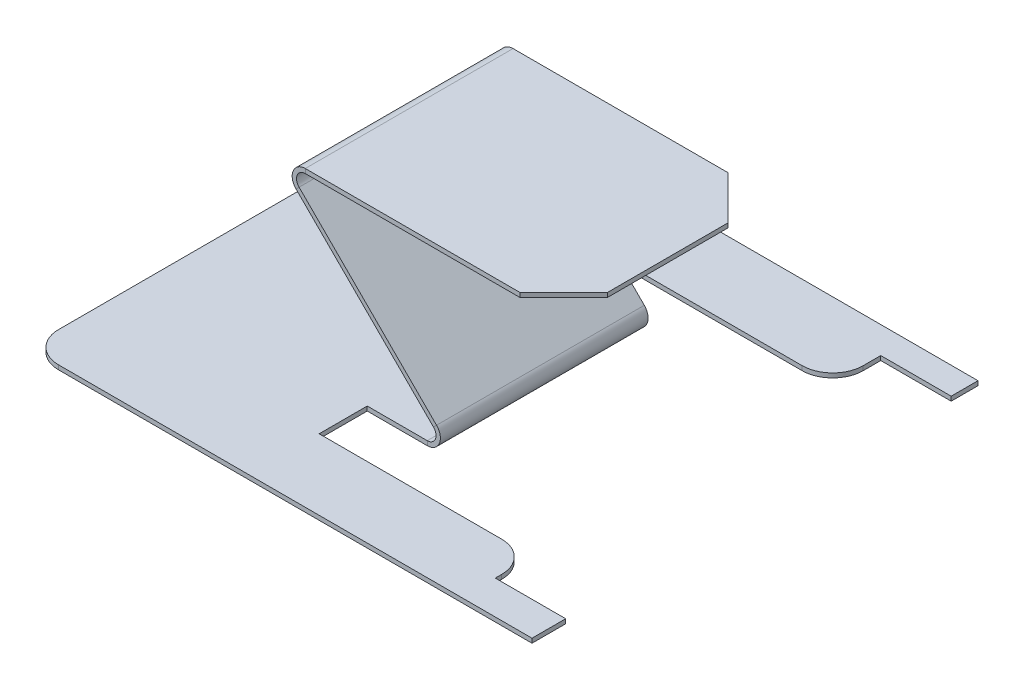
ISO-10303-21;
HEADER;
FILE_DESCRIPTION(('STEP AP214'),'2;1');
FILE_NAME('part.step','',(''),(''),'','','');
FILE_SCHEMA(('AUTOMOTIVE_DESIGN { 1 0 10303 214 1 1 1 1 }'));
ENDSEC;
DATA;
#1=APPLICATION_CONTEXT('core data for automotive mechanical design processes');
#2=APPLICATION_PROTOCOL_DEFINITION('international standard','automotive_design',2000,#1);
#3=PRODUCT_CONTEXT('',#1,'mechanical');
#4=PRODUCT('Part','Part','',(#3));
#5=PRODUCT_RELATED_PRODUCT_CATEGORY('part','',(#4));
#6=PRODUCT_DEFINITION_FORMATION('','',#4);
#7=PRODUCT_DEFINITION_CONTEXT('part definition',#1,'design');
#8=PRODUCT_DEFINITION('design','',#6,#7);
#9=PRODUCT_DEFINITION_SHAPE('','',#8);
#10=(LENGTH_UNIT() NAMED_UNIT(*) SI_UNIT(.MILLI.,.METRE.));
#11=(NAMED_UNIT(*) PLANE_ANGLE_UNIT() SI_UNIT($,.RADIAN.));
#12=(NAMED_UNIT(*) SI_UNIT($,.STERADIAN.) SOLID_ANGLE_UNIT());
#13=UNCERTAINTY_MEASURE_WITH_UNIT(LENGTH_MEASURE(1.E-05),#10,'distance_accuracy_value','');
#14=(GEOMETRIC_REPRESENTATION_CONTEXT(3) GLOBAL_UNCERTAINTY_ASSIGNED_CONTEXT((#13)) GLOBAL_UNIT_ASSIGNED_CONTEXT((#10,
#11,#12)) REPRESENTATION_CONTEXT('',''));
#15=CARTESIAN_POINT('',(0.,0.,0.));
#16=DIRECTION('',(0.,0.,1.));
#17=DIRECTION('',(1.,0.,0.));
#18=AXIS2_PLACEMENT_3D('',#15,#16,#17);
#19=CARTESIAN_POINT('',(24.2169050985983,36.4189178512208,41.4697311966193));
#20=DIRECTION('',(0.707106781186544,0.707106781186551,0.));
#21=DIRECTION('',(0.,0.,-1.));
#22=AXIS2_PLACEMENT_3D('',#19,#20,#21);
#23=PLANE('',#22);
#24=DIRECTION('',(-0.707106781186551,0.707106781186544,0.));
#25=VECTOR('',#24,1.);
#26=CARTESIAN_POINT('',(70.1039701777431,-9.46814722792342,22.0110102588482));
#27=LINE('',#26,#25);
#28=CARTESIAN_POINT('',(56.2216093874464,4.4142135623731,22.0110102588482));
#29=VERTEX_POINT('',#28);
#30=CARTESIAN_POINT('',(24.7571432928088,35.8786796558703,22.0110102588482));
#31=VERTEX_POINT('',#30);
#32=EDGE_CURVE('E428',#29,#31,#27,.T.);
#33=ORIENTED_EDGE('',*,*,#32,.T.);
#34=DIRECTION('',(0.,0.,-1.));
#35=VECTOR('',#34,1.);
#36=CARTESIAN_POINT('',(24.7571432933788,35.8786796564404,41.4697311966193));
#37=LINE('',#36,#35);
#38=CARTESIAN_POINT('',(24.7571432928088,35.8786796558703,-25.5547520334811));
#39=VERTEX_POINT('',#38);
#40=EDGE_CURVE('E269',#31,#39,#37,.T.);
#41=ORIENTED_EDGE('',*,*,#40,.T.);
#42=DIRECTION('',(0.707106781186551,-0.707106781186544,0.));
#43=VECTOR('',#42,1.);
#44=CARTESIAN_POINT('',(17.5497955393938,43.0860274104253,-25.5547520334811));
#45=LINE('',#44,#43);
#46=CARTESIAN_POINT('',(56.2216094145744,4.4142135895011,-25.5547520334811));
#47=VERTEX_POINT('',#46);
#48=EDGE_CURVE('E407',#39,#47,#45,.T.);
#49=ORIENTED_EDGE('',*,*,#48,.T.);
#50=DIRECTION('',(0.,0.,-1.));
#51=VECTOR('',#50,1.);
#52=CARTESIAN_POINT('',(56.2216093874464,4.41421356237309,41.4697311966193));
#53=LINE('',#52,#51);
#54=EDGE_CURVE('E403',#29,#47,#53,.T.);
#55=ORIENTED_EDGE('',*,*,#54,.F.);
#56=EDGE_LOOP('',(#33,#41,#49,#55));
#57=FACE_BOUND('',#56,.T.);
#58=ADVANCED_FACE('F34',(#57),#23,.F.);
#59=CARTESIAN_POINT('',(17.5497955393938,43.0860274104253,-25.5547520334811));
#60=DIRECTION('',(0.,0.,1.));
#61=DIRECTION('',(-0.707106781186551,0.707106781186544,0.));
#62=AXIS2_PLACEMENT_3D('',#59,#60,#61);
#63=PLANE('',#62);
#64=ORIENTED_EDGE('',*,*,#48,.F.);
#65=DIRECTION('',(0.707106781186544,0.707106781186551,0.));
#66=VECTOR('',#65,1.);
#67=CARTESIAN_POINT('',(24.7571432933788,35.8786796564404,-25.5547520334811));
#68=LINE('',#67,#66);
#69=CARTESIAN_POINT('',(25.4642500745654,36.5857864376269,-25.5547520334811));
#70=VERTEX_POINT('',#69);
#71=EDGE_CURVE('E422',#39,#70,#68,.T.);
#72=ORIENTED_EDGE('',*,*,#71,.T.);
#73=DIRECTION('',(0.707106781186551,-0.707106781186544,0.));
#74=VECTOR('',#73,1.);
#75=CARTESIAN_POINT('',(18.2569023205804,43.7931341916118,-25.5547520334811));
#76=LINE('',#75,#74);
#77=CARTESIAN_POINT('',(56.9287161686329,5.12132034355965,-25.5547520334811));
#78=VERTEX_POINT('',#77);
#79=EDGE_CURVE('E426',#70,#78,#76,.T.);
#80=ORIENTED_EDGE('',*,*,#79,.T.);
#81=DIRECTION('',(0.707106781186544,0.707106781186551,0.));
#82=VECTOR('',#81,1.);
#83=CARTESIAN_POINT('',(56.2216093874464,4.4142135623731,-25.5547520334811));
#84=LINE('',#83,#82);
#85=EDGE_CURVE('E406',#47,#78,#84,.T.);
#86=ORIENTED_EDGE('',*,*,#85,.F.);
#87=EDGE_LOOP('',(#64,#72,#80,#86));
#88=FACE_BOUND('',#87,.T.);
#89=ADVANCED_FACE('F36',(#88),#63,.F.);
#90=CARTESIAN_POINT('',(70.1039701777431,-9.46814722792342,22.0110102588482));
#91=DIRECTION('',(0.,0.,-1.));
#92=DIRECTION('',(0.707106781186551,-0.707106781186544,0.));
#93=AXIS2_PLACEMENT_3D('',#90,#91,#92);
#94=PLANE('',#93);
#95=DIRECTION('',(-0.707106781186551,0.707106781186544,0.));
#96=VECTOR('',#95,1.);
#97=CARTESIAN_POINT('',(70.8110769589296,-8.76104044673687,22.0110102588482));
#98=LINE('',#97,#96);
#99=CARTESIAN_POINT('',(56.928716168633,5.12132034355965,22.0110102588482));
#100=VERTEX_POINT('',#99);
#101=CARTESIAN_POINT('',(25.4642500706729,36.5857864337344,22.0110102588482));
#102=VERTEX_POINT('',#101);
#103=EDGE_CURVE('E295',#100,#102,#98,.T.);
#104=ORIENTED_EDGE('',*,*,#103,.T.);
#105=DIRECTION('',(-0.707106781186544,-0.707106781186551,0.));
#106=VECTOR('',#105,1.);
#107=CARTESIAN_POINT('',(24.7571432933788,35.8786796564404,22.0110102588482));
#108=LINE('',#107,#106);
#109=EDGE_CURVE('E417',#102,#31,#108,.T.);
#110=ORIENTED_EDGE('',*,*,#109,.T.);
#111=ORIENTED_EDGE('',*,*,#32,.F.);
#112=DIRECTION('',(-0.707106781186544,-0.707106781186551,0.));
#113=VECTOR('',#112,1.);
#114=CARTESIAN_POINT('',(56.2216093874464,4.4142135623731,22.0110102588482));
#115=LINE('',#114,#113);
#116=EDGE_CURVE('E413',#100,#29,#115,.T.);
#117=ORIENTED_EDGE('',*,*,#116,.F.);
#118=EDGE_LOOP('',(#104,#110,#111,#117));
#119=FACE_BOUND('',#118,.T.);
#120=ADVANCED_FACE('F580',(#119),#94,.F.);
#121=CARTESIAN_POINT('',(24.9240118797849,37.1260246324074,41.4697311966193));
#122=DIRECTION('',(0.707106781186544,0.707106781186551,0.));
#123=DIRECTION('',(0.,0.,-1.));
#124=AXIS2_PLACEMENT_3D('',#121,#122,#123);
#125=PLANE('',#124);
#126=DIRECTION('',(0.,0.,-1.));
#127=VECTOR('',#126,1.);
#128=CARTESIAN_POINT('',(25.4642500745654,36.5857864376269,41.4697311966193));
#129=LINE('',#128,#127);
#130=EDGE_CURVE('E420',#102,#70,#129,.T.);
#131=ORIENTED_EDGE('',*,*,#130,.F.);
#132=ORIENTED_EDGE('',*,*,#103,.F.);
#133=DIRECTION('',(0.,0.,-1.));
#134=VECTOR('',#133,1.);
#135=CARTESIAN_POINT('',(56.928716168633,5.12132034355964,41.4697311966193));
#136=LINE('',#135,#134);
#137=EDGE_CURVE('E410',#100,#78,#136,.T.);
#138=ORIENTED_EDGE('',*,*,#137,.T.);
#139=ORIENTED_EDGE('',*,*,#79,.F.);
#140=EDGE_LOOP('',(#131,#132,#138,#139));
#141=FACE_BOUND('',#140,.T.);
#142=ADVANCED_FACE('F586',(#141),#125,.T.);
#143=CARTESIAN_POINT('',(41.0652591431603,1.,33.0179635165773));
#144=DIRECTION('',(-1.,0.,0.));
#145=DIRECTION('',(0.,0.,1.));
#146=AXIS2_PLACEMENT_3D('',#143,#144,#145);
#147=PLANE('',#146);
#148=DIRECTION('',(0.,0.,-1.));
#149=VECTOR('',#148,1.);
#150=CARTESIAN_POINT('',(41.0652591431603,0.,33.0179635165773));
#151=LINE('',#150,#149);
#152=CARTESIAN_POINT('',(41.0652591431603,0.,33.0179635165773));
#153=VERTEX_POINT('',#152);
#154=CARTESIAN_POINT('',(41.0652591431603,0.,22.0110102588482));
#155=VERTEX_POINT('',#154);
#156=EDGE_CURVE('E400',#153,#155,#151,.T.);
#157=ORIENTED_EDGE('',*,*,#156,.T.);
#158=DIRECTION('',(0.,-1.,0.));
#159=VECTOR('',#158,1.);
#160=CARTESIAN_POINT('',(41.0652591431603,1.,22.0110102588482));
#161=LINE('',#160,#159);
#162=CARTESIAN_POINT('',(41.0652591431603,1.,22.0110102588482));
#163=VERTEX_POINT('',#162);
#164=EDGE_CURVE('E292',#163,#155,#161,.T.);
#165=ORIENTED_EDGE('',*,*,#164,.F.);
#166=DIRECTION('',(0.,0.,-1.));
#167=VECTOR('',#166,1.);
#168=CARTESIAN_POINT('',(41.0652591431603,1.,33.0179635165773));
#169=LINE('',#168,#167);
#170=CARTESIAN_POINT('',(41.0652591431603,1.,33.0179635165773));
#171=VERTEX_POINT('',#170);
#172=EDGE_CURVE('E307',#171,#163,#169,.T.);
#173=ORIENTED_EDGE('',*,*,#172,.F.);
#174=DIRECTION('',(0.,-1.,0.));
#175=VECTOR('',#174,1.);
#176=CARTESIAN_POINT('',(41.0652591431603,1.,33.0179635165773));
#177=LINE('',#176,#175);
#178=EDGE_CURVE('E397',#171,#153,#177,.T.);
#179=ORIENTED_EDGE('',*,*,#178,.T.);
#180=EDGE_LOOP('',(#157,#165,#173,#179));
#181=FACE_BOUND('',#180,.T.);
#182=ADVANCED_FACE('F494',(#181),#147,.F.);
#183=CARTESIAN_POINT('',(89.8362298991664,1.,33.0179635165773));
#184=DIRECTION('',(0.,0.,1.));
#185=DIRECTION('',(1.,0.,0.));
#186=AXIS2_PLACEMENT_3D('',#183,#184,#185);
#187=PLANE('',#186);
#188=DIRECTION('',(-1.,0.,0.));
#189=VECTOR('',#188,1.);
#190=CARTESIAN_POINT('',(89.8362298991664,1.,33.0179635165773));
#191=LINE('',#190,#189);
#192=CARTESIAN_POINT('',(82.8362298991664,1.,33.0179635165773));
#193=VERTEX_POINT('',#192);
#194=EDGE_CURVE('E309',#193,#171,#191,.T.);
#195=ORIENTED_EDGE('',*,*,#194,.F.);
#196=DIRECTION('',(0.,-1.,0.));
#197=VECTOR('',#196,1.);
#198=CARTESIAN_POINT('',(82.8362298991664,1.,33.0179635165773));
#199=LINE('',#198,#197);
#200=CARTESIAN_POINT('',(82.8362298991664,0.,33.0179635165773));
#201=VERTEX_POINT('',#200);
#202=EDGE_CURVE('E477',#193,#201,#199,.T.);
#203=ORIENTED_EDGE('',*,*,#202,.T.);
#204=DIRECTION('',(-1.,0.,0.));
#205=VECTOR('',#204,1.);
#206=CARTESIAN_POINT('',(89.8362298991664,0.,33.0179635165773));
#207=LINE('',#206,#205);
#208=EDGE_CURVE('E395',#201,#153,#207,.T.);
#209=ORIENTED_EDGE('',*,*,#208,.T.);
#210=ORIENTED_EDGE('',*,*,#178,.F.);
#211=EDGE_LOOP('',(#195,#203,#209,#210));
#212=FACE_BOUND('',#211,.T.);
#213=ADVANCED_FACE('F482',(#212),#187,.F.);
#214=CARTESIAN_POINT('',(89.8362298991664,1.,33.0179635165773));
#215=DIRECTION('',(-1.,0.,0.));
#216=DIRECTION('',(0.,0.,1.));
#217=AXIS2_PLACEMENT_3D('',#214,#215,#216);
#218=PLANE('',#217);
#219=DIRECTION('',(0.,0.,-1.));
#220=VECTOR('',#219,1.);
#221=CARTESIAN_POINT('',(89.8362298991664,0.,33.0179635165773));
#222=LINE('',#221,#220);
#223=CARTESIAN_POINT('',(89.8362298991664,0.,41.4697311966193));
#224=VERTEX_POINT('',#223);
#225=CARTESIAN_POINT('',(89.8362298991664,0.,40.0179635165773));
#226=VERTEX_POINT('',#225);
#227=EDGE_CURVE('E393',#224,#226,#222,.T.);
#228=ORIENTED_EDGE('',*,*,#227,.T.);
#229=DIRECTION('',(0.,-1.,0.));
#230=VECTOR('',#229,1.);
#231=CARTESIAN_POINT('',(89.8362298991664,1.,40.0179635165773));
#232=LINE('',#231,#230);
#233=CARTESIAN_POINT('',(89.8362298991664,1.,40.0179635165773));
#234=VERTEX_POINT('',#233);
#235=EDGE_CURVE('E42',#226,#234,#232,.F.);
#236=ORIENTED_EDGE('',*,*,#235,.T.);
#237=DIRECTION('',(0.,0.,-1.));
#238=VECTOR('',#237,1.);
#239=CARTESIAN_POINT('',(89.8362298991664,1.,33.0179635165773));
#240=LINE('',#239,#238);
#241=CARTESIAN_POINT('',(89.8362298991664,1.,41.4697311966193));
#242=VERTEX_POINT('',#241);
#243=EDGE_CURVE('E311',#242,#234,#240,.T.);
#244=ORIENTED_EDGE('',*,*,#243,.F.);
#245=DIRECTION('',(0.,-1.,0.));
#246=VECTOR('',#245,1.);
#247=CARTESIAN_POINT('',(89.8362298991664,1.,41.4697311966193));
#248=LINE('',#247,#246);
#249=EDGE_CURVE('E390',#242,#224,#248,.T.);
#250=ORIENTED_EDGE('',*,*,#249,.T.);
#251=EDGE_LOOP('',(#228,#236,#244,#250));
#252=FACE_BOUND('',#251,.T.);
#253=ADVANCED_FACE('F564',(#252),#218,.F.);
#254=CARTESIAN_POINT('',(89.8362298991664,1.,41.4697311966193));
#255=DIRECTION('',(0.,0.,1.));
#256=DIRECTION('',(1.,0.,0.));
#257=AXIS2_PLACEMENT_3D('',#254,#255,#256);
#258=PLANE('',#257);
#259=DIRECTION('',(-1.,0.,0.));
#260=VECTOR('',#259,1.);
#261=CARTESIAN_POINT('',(89.8362298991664,0.,41.4697311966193));
#262=LINE('',#261,#260);
#263=CARTESIAN_POINT('',(105.959368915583,0.,41.4697311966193));
#264=VERTEX_POINT('',#263);
#265=EDGE_CURVE('E388',#264,#224,#262,.T.);
#266=ORIENTED_EDGE('',*,*,#265,.T.);
#267=ORIENTED_EDGE('',*,*,#249,.F.);
#268=DIRECTION('',(-1.,0.,0.));
#269=VECTOR('',#268,1.);
#270=CARTESIAN_POINT('',(89.8362298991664,1.,41.4697311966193));
#271=LINE('',#270,#269);
#272=CARTESIAN_POINT('',(105.959368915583,1.,41.4697311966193));
#273=VERTEX_POINT('',#272);
#274=EDGE_CURVE('E313',#273,#242,#271,.T.);
#275=ORIENTED_EDGE('',*,*,#274,.F.);
#276=DIRECTION('',(0.,-1.,0.));
#277=VECTOR('',#276,1.);
#278=CARTESIAN_POINT('',(105.959368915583,1.,41.4697311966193));
#279=LINE('',#278,#277);
#280=EDGE_CURVE('E385',#273,#264,#279,.T.);
#281=ORIENTED_EDGE('',*,*,#280,.T.);
#282=EDGE_LOOP('',(#266,#267,#275,#281));
#283=FACE_BOUND('',#282,.T.);
#284=ADVANCED_FACE('F563',(#283),#258,.F.);
#285=CARTESIAN_POINT('',(105.959368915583,1.,49.1848728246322));
#286=DIRECTION('',(-1.,0.,0.));
#287=DIRECTION('',(0.,0.,1.));
#288=AXIS2_PLACEMENT_3D('',#285,#286,#287);
#289=PLANE('',#288);
#290=DIRECTION('',(0.,0.,-1.));
#291=VECTOR('',#290,1.);
#292=CARTESIAN_POINT('',(105.959368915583,0.,49.1848728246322));
#293=LINE('',#292,#291);
#294=CARTESIAN_POINT('',(105.959368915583,0.,49.1848728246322));
#295=VERTEX_POINT('',#294);
#296=EDGE_CURVE('E382',#295,#264,#293,.T.);
#297=ORIENTED_EDGE('',*,*,#296,.T.);
#298=ORIENTED_EDGE('',*,*,#280,.F.);
#299=DIRECTION('',(0.,0.,-1.));
#300=VECTOR('',#299,1.);
#301=CARTESIAN_POINT('',(105.959368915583,1.,49.1848728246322));
#302=LINE('',#301,#300);
#303=CARTESIAN_POINT('',(105.959368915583,1.,49.1848728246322));
#304=VERTEX_POINT('',#303);
#305=EDGE_CURVE('E315',#304,#273,#302,.T.);
#306=ORIENTED_EDGE('',*,*,#305,.F.);
#307=DIRECTION('',(0.,-1.,0.));
#308=VECTOR('',#307,1.);
#309=CARTESIAN_POINT('',(105.959368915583,1.,49.1848728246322));
#310=LINE('',#309,#308);
#311=EDGE_CURVE('E379',#304,#295,#310,.T.);
#312=ORIENTED_EDGE('',*,*,#311,.T.);
#313=EDGE_LOOP('',(#297,#298,#306,#312));
#314=FACE_BOUND('',#313,.T.);
#315=ADVANCED_FACE('F561',(#314),#289,.F.);
#316=CARTESIAN_POINT('',(105.959368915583,1.,49.1848728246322));
#317=DIRECTION('',(0.,0.,-1.));
#318=DIRECTION('',(-1.,0.,0.));
#319=AXIS2_PLACEMENT_3D('',#316,#317,#318);
#320=PLANE('',#319);
#321=DIRECTION('',(1.,0.,0.));
#322=VECTOR('',#321,1.);
#323=CARTESIAN_POINT('',(105.959368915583,1.,49.1848728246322));
#324=LINE('',#323,#322);
#325=CARTESIAN_POINT('',(-2.42871676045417,1.,49.1848728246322));
#326=VERTEX_POINT('',#325);
#327=EDGE_CURVE('E318',#326,#304,#324,.T.);
#328=ORIENTED_EDGE('',*,*,#327,.F.);
#329=DIRECTION('',(0.,-1.,0.));
#330=VECTOR('',#329,1.);
#331=CARTESIAN_POINT('',(-2.4287167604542,1.,49.1848728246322));
#332=LINE('',#331,#330);
#333=CARTESIAN_POINT('',(-2.42871676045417,0.,49.1848728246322));
#334=VERTEX_POINT('',#333);
#335=EDGE_CURVE('E11',#326,#334,#332,.T.);
#336=ORIENTED_EDGE('',*,*,#335,.T.);
#337=DIRECTION('',(1.,0.,0.));
#338=VECTOR('',#337,1.);
#339=CARTESIAN_POINT('',(105.959368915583,0.,49.1848728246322));
#340=LINE('',#339,#338);
#341=EDGE_CURVE('E377',#334,#295,#340,.T.);
#342=ORIENTED_EDGE('',*,*,#341,.T.);
#343=ORIENTED_EDGE('',*,*,#311,.F.);
#344=EDGE_LOOP('',(#328,#336,#342,#343));
#345=FACE_BOUND('',#344,.T.);
#346=ADVANCED_FACE('F555',(#345),#320,.F.);
#347=CARTESIAN_POINT('',(-9.4287167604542,1.,49.1848728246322));
#348=DIRECTION('',(1.,0.,0.));
#349=DIRECTION('',(0.,0.,-1.));
#350=AXIS2_PLACEMENT_3D('',#347,#348,#349);
#351=PLANE('',#350);
#352=DIRECTION('',(0.,0.,1.));
#353=VECTOR('',#352,1.);
#354=CARTESIAN_POINT('',(-9.4287167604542,1.,49.1848728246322));
#355=LINE('',#354,#353);
#356=CARTESIAN_POINT('',(-9.4287167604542,1.,-45.9251673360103));
#357=VERTEX_POINT('',#356);
#358=CARTESIAN_POINT('',(-9.4287167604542,1.,42.1848728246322));
#359=VERTEX_POINT('',#358);
#360=EDGE_CURVE('E320',#357,#359,#355,.T.);
#361=ORIENTED_EDGE('',*,*,#360,.F.);
#362=DIRECTION('',(0.,-1.,0.));
#363=VECTOR('',#362,1.);
#364=CARTESIAN_POINT('',(-9.4287167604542,1.,-45.9251673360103));
#365=LINE('',#364,#363);
#366=CARTESIAN_POINT('',(-9.4287167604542,0.,-45.9251673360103));
#367=VERTEX_POINT('',#366);
#368=EDGE_CURVE('E452',#357,#367,#365,.T.);
#369=ORIENTED_EDGE('',*,*,#368,.T.);
#370=DIRECTION('',(0.,0.,1.));
#371=VECTOR('',#370,1.);
#372=CARTESIAN_POINT('',(-9.4287167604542,0.,49.1848728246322));
#373=LINE('',#372,#371);
#374=CARTESIAN_POINT('',(-9.4287167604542,0.,42.1848728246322));
#375=VERTEX_POINT('',#374);
#376=EDGE_CURVE('E374',#367,#375,#373,.T.);
#377=ORIENTED_EDGE('',*,*,#376,.T.);
#378=DIRECTION('',(0.,-1.,0.));
#379=VECTOR('',#378,1.);
#380=CARTESIAN_POINT('',(-9.4287167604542,1.,42.1848728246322));
#381=LINE('',#380,#379);
#382=EDGE_CURVE('E450',#375,#359,#381,.F.);
#383=ORIENTED_EDGE('',*,*,#382,.T.);
#384=EDGE_LOOP('',(#361,#369,#377,#383));
#385=FACE_BOUND('',#384,.T.);
#386=ADVANCED_FACE('F545',(#385),#351,.F.);
#387=CARTESIAN_POINT('',(105.959368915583,1.,-52.9251673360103));
#388=DIRECTION('',(0.,0.,1.));
#389=DIRECTION('',(1.,0.,0.));
#390=AXIS2_PLACEMENT_3D('',#387,#388,#389);
#391=PLANE('',#390);
#392=DIRECTION('',(-1.,0.,0.));
#393=VECTOR('',#392,1.);
#394=CARTESIAN_POINT('',(105.959368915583,0.,-52.9251673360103));
#395=LINE('',#394,#393);
#396=CARTESIAN_POINT('',(105.959368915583,0.,-52.9251673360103));
#397=VERTEX_POINT('',#396);
#398=CARTESIAN_POINT('',(-2.42871676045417,0.,-52.9251673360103));
#399=VERTEX_POINT('',#398);
#400=EDGE_CURVE('E371',#397,#399,#395,.T.);
#401=ORIENTED_EDGE('',*,*,#400,.T.);
#402=DIRECTION('',(0.,-1.,0.));
#403=VECTOR('',#402,1.);
#404=CARTESIAN_POINT('',(-2.4287167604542,1.,-52.9251673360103));
#405=LINE('',#404,#403);
#406=CARTESIAN_POINT('',(-2.42871676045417,1.,-52.9251673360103));
#407=VERTEX_POINT('',#406);
#408=EDGE_CURVE('E463',#399,#407,#405,.F.);
#409=ORIENTED_EDGE('',*,*,#408,.T.);
#410=DIRECTION('',(-1.,0.,0.));
#411=VECTOR('',#410,1.);
#412=CARTESIAN_POINT('',(105.959368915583,1.,-52.9251673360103));
#413=LINE('',#412,#411);
#414=CARTESIAN_POINT('',(105.959368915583,1.,-52.9251673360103));
#415=VERTEX_POINT('',#414);
#416=EDGE_CURVE('E323',#415,#407,#413,.T.);
#417=ORIENTED_EDGE('',*,*,#416,.F.);
#418=DIRECTION('',(0.,-1.,0.));
#419=VECTOR('',#418,1.);
#420=CARTESIAN_POINT('',(105.959368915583,1.,-52.9251673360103));
#421=LINE('',#420,#419);
#422=EDGE_CURVE('E368',#415,#397,#421,.T.);
#423=ORIENTED_EDGE('',*,*,#422,.T.);
#424=EDGE_LOOP('',(#401,#409,#417,#423));
#425=FACE_BOUND('',#424,.T.);
#426=ADVANCED_FACE('F686',(#425),#391,.F.);
#427=CARTESIAN_POINT('',(105.959368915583,1.,-46.7824476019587));
#428=DIRECTION('',(-1.,0.,0.));
#429=DIRECTION('',(0.,0.,1.));
#430=AXIS2_PLACEMENT_3D('',#427,#428,#429);
#431=PLANE('',#430);
#432=DIRECTION('',(0.,0.,-1.));
#433=VECTOR('',#432,1.);
#434=CARTESIAN_POINT('',(105.959368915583,0.,-46.7824476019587));
#435=LINE('',#434,#433);
#436=CARTESIAN_POINT('',(105.959368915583,0.,-46.7824476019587));
#437=VERTEX_POINT('',#436);
#438=EDGE_CURVE('E366',#437,#397,#435,.T.);
#439=ORIENTED_EDGE('',*,*,#438,.T.);
#440=ORIENTED_EDGE('',*,*,#422,.F.);
#441=DIRECTION('',(0.,0.,-1.));
#442=VECTOR('',#441,1.);
#443=CARTESIAN_POINT('',(105.959368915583,1.,-46.7824476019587));
#444=LINE('',#443,#442);
#445=CARTESIAN_POINT('',(105.959368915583,1.,-46.7824476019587));
#446=VERTEX_POINT('',#445);
#447=EDGE_CURVE('E326',#446,#415,#444,.T.);
#448=ORIENTED_EDGE('',*,*,#447,.F.);
#449=DIRECTION('',(0.,-1.,0.));
#450=VECTOR('',#449,1.);
#451=CARTESIAN_POINT('',(105.959368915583,1.,-46.7824476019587));
#452=LINE('',#451,#450);
#453=EDGE_CURVE('E363',#446,#437,#452,.T.);
#454=ORIENTED_EDGE('',*,*,#453,.T.);
#455=EDGE_LOOP('',(#439,#440,#448,#454));
#456=FACE_BOUND('',#455,.T.);
#457=ADVANCED_FACE('F534',(#456),#431,.F.);
#458=CARTESIAN_POINT('',(89.8362298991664,1.,-46.7824476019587));
#459=DIRECTION('',(0.,0.,-1.));
#460=DIRECTION('',(-1.,0.,0.));
#461=AXIS2_PLACEMENT_3D('',#458,#459,#460);
#462=PLANE('',#461);
#463=DIRECTION('',(1.,0.,0.));
#464=VECTOR('',#463,1.);
#465=CARTESIAN_POINT('',(89.8362298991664,0.,-46.7824476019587));
#466=LINE('',#465,#464);
#467=CARTESIAN_POINT('',(89.8362298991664,0.,-46.7824476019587));
#468=VERTEX_POINT('',#467);
#469=EDGE_CURVE('E361',#468,#437,#466,.T.);
#470=ORIENTED_EDGE('',*,*,#469,.T.);
#471=ORIENTED_EDGE('',*,*,#453,.F.);
#472=DIRECTION('',(1.,0.,0.));
#473=VECTOR('',#472,1.);
#474=CARTESIAN_POINT('',(89.8362298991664,1.,-46.7824476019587));
#475=LINE('',#474,#473);
#476=CARTESIAN_POINT('',(89.8362298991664,1.,-46.7824476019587));
#477=VERTEX_POINT('',#476);
#478=EDGE_CURVE('E328',#477,#446,#475,.T.);
#479=ORIENTED_EDGE('',*,*,#478,.F.);
#480=DIRECTION('',(0.,-1.,0.));
#481=VECTOR('',#480,1.);
#482=CARTESIAN_POINT('',(89.8362298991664,1.,-46.7824476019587));
#483=LINE('',#482,#481);
#484=EDGE_CURVE('E358',#477,#468,#483,.T.);
#485=ORIENTED_EDGE('',*,*,#484,.T.);
#486=EDGE_LOOP('',(#470,#471,#479,#485));
#487=FACE_BOUND('',#486,.T.);
#488=ADVANCED_FACE('F530',(#487),#462,.F.);
#489=CARTESIAN_POINT('',(89.8362298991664,1.,-35.7754943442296));
#490=DIRECTION('',(-1.,0.,0.));
#491=DIRECTION('',(0.,0.,1.));
#492=AXIS2_PLACEMENT_3D('',#489,#490,#491);
#493=PLANE('',#492);
#494=DIRECTION('',(0.,0.,-1.));
#495=VECTOR('',#494,1.);
#496=CARTESIAN_POINT('',(89.8362298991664,1.,-35.7754943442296));
#497=LINE('',#496,#495);
#498=CARTESIAN_POINT('',(89.8362298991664,1.,-42.7754943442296));
#499=VERTEX_POINT('',#498);
#500=EDGE_CURVE('E330',#499,#477,#497,.T.);
#501=ORIENTED_EDGE('',*,*,#500,.F.);
#502=DIRECTION('',(0.,-1.,0.));
#503=VECTOR('',#502,1.);
#504=CARTESIAN_POINT('',(89.8362298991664,1.,-42.7754943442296));
#505=LINE('',#504,#503);
#506=CARTESIAN_POINT('',(89.8362298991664,0.,-42.7754943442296));
#507=VERTEX_POINT('',#506);
#508=EDGE_CURVE('E472',#499,#507,#505,.T.);
#509=ORIENTED_EDGE('',*,*,#508,.T.);
#510=DIRECTION('',(0.,0.,-1.));
#511=VECTOR('',#510,1.);
#512=CARTESIAN_POINT('',(89.8362298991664,0.,-35.7754943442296));
#513=LINE('',#512,#511);
#514=EDGE_CURVE('E356',#507,#468,#513,.T.);
#515=ORIENTED_EDGE('',*,*,#514,.T.);
#516=ORIENTED_EDGE('',*,*,#484,.F.);
#517=EDGE_LOOP('',(#501,#509,#515,#516));
#518=FACE_BOUND('',#517,.T.);
#519=ADVANCED_FACE('F522',(#518),#493,.F.);
#520=CARTESIAN_POINT('',(41.0652591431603,1.,-35.7754943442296));
#521=DIRECTION('',(0.,0.,-1.));
#522=DIRECTION('',(-1.,0.,0.));
#523=AXIS2_PLACEMENT_3D('',#520,#521,#522);
#524=PLANE('',#523);
#525=DIRECTION('',(1.,0.,0.));
#526=VECTOR('',#525,1.);
#527=CARTESIAN_POINT('',(41.0652591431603,0.,-35.7754943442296));
#528=LINE('',#527,#526);
#529=CARTESIAN_POINT('',(41.0652591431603,0.,-35.7754943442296));
#530=VERTEX_POINT('',#529);
#531=CARTESIAN_POINT('',(82.8362298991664,0.,-35.7754943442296));
#532=VERTEX_POINT('',#531);
#533=EDGE_CURVE('E353',#530,#532,#528,.T.);
#534=ORIENTED_EDGE('',*,*,#533,.T.);
#535=DIRECTION('',(0.,-1.,0.));
#536=VECTOR('',#535,1.);
#537=CARTESIAN_POINT('',(82.8362298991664,1.,-35.7754943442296));
#538=LINE('',#537,#536);
#539=CARTESIAN_POINT('',(82.8362298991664,1.,-35.7754943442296));
#540=VERTEX_POINT('',#539);
#541=EDGE_CURVE('E475',#532,#540,#538,.F.);
#542=ORIENTED_EDGE('',*,*,#541,.T.);
#543=DIRECTION('',(1.,0.,0.));
#544=VECTOR('',#543,1.);
#545=CARTESIAN_POINT('',(41.0652591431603,1.,-35.7754943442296));
#546=LINE('',#545,#544);
#547=CARTESIAN_POINT('',(41.0652591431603,1.,-35.7754943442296));
#548=VERTEX_POINT('',#547);
#549=EDGE_CURVE('E332',#548,#540,#546,.T.);
#550=ORIENTED_EDGE('',*,*,#549,.F.);
#551=DIRECTION('',(0.,-1.,0.));
#552=VECTOR('',#551,1.);
#553=CARTESIAN_POINT('',(41.0652591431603,1.,-35.7754943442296));
#554=LINE('',#553,#552);
#555=EDGE_CURVE('E350',#548,#530,#554,.T.);
#556=ORIENTED_EDGE('',*,*,#555,.T.);
#557=EDGE_LOOP('',(#534,#542,#550,#556));
#558=FACE_BOUND('',#557,.T.);
#559=ADVANCED_FACE('F695',(#558),#524,.F.);
#560=CARTESIAN_POINT('',(41.0652591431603,1.,-25.5547520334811));
#561=DIRECTION('',(-1.,0.,0.));
#562=DIRECTION('',(0.,0.,1.));
#563=AXIS2_PLACEMENT_3D('',#560,#561,#562);
#564=PLANE('',#563);
#565=DIRECTION('',(0.,0.,-1.));
#566=VECTOR('',#565,1.);
#567=CARTESIAN_POINT('',(41.0652591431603,0.,-25.5547520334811));
#568=LINE('',#567,#566);
#569=CARTESIAN_POINT('',(41.0652591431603,0.,-25.5547520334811));
#570=VERTEX_POINT('',#569);
#571=EDGE_CURVE('E348',#570,#530,#568,.T.);
#572=ORIENTED_EDGE('',*,*,#571,.T.);
#573=ORIENTED_EDGE('',*,*,#555,.F.);
#574=DIRECTION('',(0.,0.,-1.));
#575=VECTOR('',#574,1.);
#576=CARTESIAN_POINT('',(41.0652591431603,1.,-25.5547520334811));
#577=LINE('',#576,#575);
#578=CARTESIAN_POINT('',(41.0652591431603,1.,-25.5547520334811));
#579=VERTEX_POINT('',#578);
#580=EDGE_CURVE('E335',#579,#548,#577,.T.);
#581=ORIENTED_EDGE('',*,*,#580,.F.);
#582=DIRECTION('',(0.,-1.,0.));
#583=VECTOR('',#582,1.);
#584=CARTESIAN_POINT('',(41.0652591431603,1.,-25.5547520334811));
#585=LINE('',#584,#583);
#586=EDGE_CURVE('E345',#579,#570,#585,.T.);
#587=ORIENTED_EDGE('',*,*,#586,.T.);
#588=EDGE_LOOP('',(#572,#573,#581,#587));
#589=FACE_BOUND('',#588,.T.);
#590=ADVANCED_FACE('F511',(#589),#564,.F.);
#591=CARTESIAN_POINT('',(105.959368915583,1.,41.4697311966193));
#592=DIRECTION('',(0.,-1.,0.));
#593=DIRECTION('',(0.,0.,-1.));
#594=AXIS2_PLACEMENT_3D('',#591,#592,#593);
#595=PLANE('',#594);
#596=ORIENTED_EDGE('',*,*,#416,.T.);
#597=CARTESIAN_POINT('',(-2.4287167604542,1.,-45.9251673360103));
#598=DIRECTION('',(0.,-1.,0.));
#599=DIRECTION('',(0.,0.,-1.));
#600=AXIS2_PLACEMENT_3D('',#597,#598,#599);
#601=CIRCLE('',#600,7.);
#602=EDGE_CURVE('E470',#407,#357,#601,.F.);
#603=ORIENTED_EDGE('',*,*,#602,.T.);
#604=ORIENTED_EDGE('',*,*,#360,.T.);
#605=CARTESIAN_POINT('',(-2.4287167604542,1.,42.1848728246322));
#606=DIRECTION('',(0.,-1.,0.));
#607=DIRECTION('',(0.,0.,-1.));
#608=AXIS2_PLACEMENT_3D('',#605,#606,#607);
#609=CIRCLE('',#608,7.);
#610=EDGE_CURVE('E465',#359,#326,#609,.F.);
#611=ORIENTED_EDGE('',*,*,#610,.T.);
#612=ORIENTED_EDGE('',*,*,#327,.T.);
#613=ORIENTED_EDGE('',*,*,#305,.T.);
#614=ORIENTED_EDGE('',*,*,#274,.T.);
#615=ORIENTED_EDGE('',*,*,#243,.T.);
#616=CARTESIAN_POINT('',(82.8362298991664,1.,40.0179635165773));
#617=DIRECTION('',(0.,-1.,0.));
#618=DIRECTION('',(0.,0.,-1.));
#619=AXIS2_PLACEMENT_3D('',#616,#617,#618);
#620=CIRCLE('',#619,7.);
#621=EDGE_CURVE('E49',#234,#193,#620,.F.);
#622=ORIENTED_EDGE('',*,*,#621,.T.);
#623=ORIENTED_EDGE('',*,*,#194,.T.);
#624=ORIENTED_EDGE('',*,*,#172,.T.);
#625=DIRECTION('',(1.,0.,0.));
#626=VECTOR('',#625,1.);
#627=CARTESIAN_POINT('',(41.0652591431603,1.,22.0110102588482));
#628=LINE('',#627,#626);
#629=CARTESIAN_POINT('',(54.8073958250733,0.999999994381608,22.0110102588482));
#630=VERTEX_POINT('',#629);
#631=EDGE_CURVE('E342',#163,#630,#628,.T.);
#632=ORIENTED_EDGE('',*,*,#631,.T.);
#633=DIRECTION('',(0.,0.,-1.));
#634=VECTOR('',#633,1.);
#635=CARTESIAN_POINT('',(54.8073958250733,1.,41.4697311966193));
#636=LINE('',#635,#634);
#637=CARTESIAN_POINT('',(54.8073958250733,0.999999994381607,-25.5547520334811));
#638=VERTEX_POINT('',#637);
#639=EDGE_CURVE('E339',#630,#638,#636,.T.);
#640=ORIENTED_EDGE('',*,*,#639,.T.);
#641=DIRECTION('',(-1.,0.,0.));
#642=VECTOR('',#641,1.);
#643=CARTESIAN_POINT('',(115.388085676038,1.,-25.5547520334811));
#644=LINE('',#643,#642);
#645=EDGE_CURVE('E337',#638,#579,#644,.T.);
#646=ORIENTED_EDGE('',*,*,#645,.T.);
#647=ORIENTED_EDGE('',*,*,#580,.T.);
#648=ORIENTED_EDGE('',*,*,#549,.T.);
#649=CARTESIAN_POINT('',(82.8362298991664,1.,-42.7754943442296));
#650=DIRECTION('',(0.,-1.,0.));
#651=DIRECTION('',(0.,0.,-1.));
#652=AXIS2_PLACEMENT_3D('',#649,#650,#651);
#653=CIRCLE('',#652,7.);
#654=EDGE_CURVE('E468',#540,#499,#653,.F.);
#655=ORIENTED_EDGE('',*,*,#654,.T.);
#656=ORIENTED_EDGE('',*,*,#500,.T.);
#657=ORIENTED_EDGE('',*,*,#478,.T.);
#658=ORIENTED_EDGE('',*,*,#447,.T.);
#659=EDGE_LOOP('',(#596,#603,#604,#611,#612,#613,#614,#615,#622,#623,#624,#632,#640,#646,#647,
#648,#655,#656,#657,#658));
#660=FACE_BOUND('',#659,.T.);
#661=ADVANCED_FACE('F499',(#660),#595,.F.);
#662=CARTESIAN_POINT('',(115.388085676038,1.,-25.5547520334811));
#663=DIRECTION('',(0.,0.,1.));
#664=DIRECTION('',(1.,0.,0.));
#665=AXIS2_PLACEMENT_3D('',#662,#663,#664);
#666=PLANE('',#665);
#667=ORIENTED_EDGE('',*,*,#645,.F.);
#668=DIRECTION('',(0.,-1.,0.));
#669=VECTOR('',#668,1.);
#670=CARTESIAN_POINT('',(54.8073958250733,1.,-25.5547520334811));
#671=LINE('',#670,#669);
#672=CARTESIAN_POINT('',(54.8073958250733,0.,-25.5547520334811));
#673=VERTEX_POINT('',#672);
#674=EDGE_CURVE('E304',#638,#673,#671,.T.);
#675=ORIENTED_EDGE('',*,*,#674,.T.);
#676=DIRECTION('',(-1.,0.,0.));
#677=VECTOR('',#676,1.);
#678=CARTESIAN_POINT('',(115.388085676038,0.,-25.5547520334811));
#679=LINE('',#678,#677);
#680=EDGE_CURVE('E302',#673,#570,#679,.T.);
#681=ORIENTED_EDGE('',*,*,#680,.T.);
#682=ORIENTED_EDGE('',*,*,#586,.F.);
#683=EDGE_LOOP('',(#667,#675,#681,#682));
#684=FACE_BOUND('',#683,.T.);
#685=ADVANCED_FACE('F505',(#684),#666,.F.);
#686=CARTESIAN_POINT('',(105.959368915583,0.,41.4697311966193));
#687=DIRECTION('',(0.,-1.,0.));
#688=DIRECTION('',(0.,0.,-1.));
#689=AXIS2_PLACEMENT_3D('',#686,#687,#688);
#690=PLANE('',#689);
#691=ORIENTED_EDGE('',*,*,#376,.F.);
#692=CARTESIAN_POINT('',(-2.4287167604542,0.,-45.9251673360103));
#693=DIRECTION('',(0.,-1.,0.));
#694=DIRECTION('',(0.,0.,-1.));
#695=AXIS2_PLACEMENT_3D('',#692,#693,#694);
#696=CIRCLE('',#695,7.);
#697=EDGE_CURVE('E461',#367,#399,#696,.T.);
#698=ORIENTED_EDGE('',*,*,#697,.T.);
#699=ORIENTED_EDGE('',*,*,#400,.F.);
#700=ORIENTED_EDGE('',*,*,#438,.F.);
#701=ORIENTED_EDGE('',*,*,#469,.F.);
#702=ORIENTED_EDGE('',*,*,#514,.F.);
#703=CARTESIAN_POINT('',(82.8362298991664,0.,-42.7754943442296));
#704=DIRECTION('',(0.,-1.,0.));
#705=DIRECTION('',(0.,0.,-1.));
#706=AXIS2_PLACEMENT_3D('',#703,#704,#705);
#707=CIRCLE('',#706,7.);
#708=EDGE_CURVE('E459',#507,#532,#707,.T.);
#709=ORIENTED_EDGE('',*,*,#708,.T.);
#710=ORIENTED_EDGE('',*,*,#533,.F.);
#711=ORIENTED_EDGE('',*,*,#571,.F.);
#712=ORIENTED_EDGE('',*,*,#680,.F.);
#713=DIRECTION('',(0.,0.,-1.));
#714=VECTOR('',#713,1.);
#715=CARTESIAN_POINT('',(54.8073958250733,0.,41.4697311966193));
#716=LINE('',#715,#714);
#717=CARTESIAN_POINT('',(54.8073958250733,-3.83647961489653E-08,22.0110102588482));
#718=VERTEX_POINT('',#717);
#719=EDGE_CURVE('E291',#718,#673,#716,.T.);
#720=ORIENTED_EDGE('',*,*,#719,.F.);
#721=DIRECTION('',(1.,0.,0.));
#722=VECTOR('',#721,1.);
#723=CARTESIAN_POINT('',(41.0652591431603,0.,22.0110102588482));
#724=LINE('',#723,#722);
#725=EDGE_CURVE('E299',#155,#718,#724,.T.);
#726=ORIENTED_EDGE('',*,*,#725,.F.);
#727=ORIENTED_EDGE('',*,*,#156,.F.);
#728=ORIENTED_EDGE('',*,*,#208,.F.);
#729=CARTESIAN_POINT('',(82.8362298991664,0.,40.0179635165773));
#730=DIRECTION('',(0.,-1.,0.));
#731=DIRECTION('',(0.,0.,-1.));
#732=AXIS2_PLACEMENT_3D('',#729,#730,#731);
#733=CIRCLE('',#732,7.);
#734=EDGE_CURVE('E457',#201,#226,#733,.T.);
#735=ORIENTED_EDGE('',*,*,#734,.T.);
#736=ORIENTED_EDGE('',*,*,#227,.F.);
#737=ORIENTED_EDGE('',*,*,#265,.F.);
#738=ORIENTED_EDGE('',*,*,#296,.F.);
#739=ORIENTED_EDGE('',*,*,#341,.F.);
#740=CARTESIAN_POINT('',(-2.4287167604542,0.,42.1848728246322));
#741=DIRECTION('',(0.,-1.,0.));
#742=DIRECTION('',(0.,0.,-1.));
#743=AXIS2_PLACEMENT_3D('',#740,#741,#742);
#744=CIRCLE('',#743,7.);
#745=EDGE_CURVE('E455',#334,#375,#744,.T.);
#746=ORIENTED_EDGE('',*,*,#745,.T.);
#747=EDGE_LOOP('',(#691,#698,#699,#700,#701,#702,#709,#710,#711,#712,#720,#726,#727,#728,#735,
#736,#737,#738,#739,#746));
#748=FACE_BOUND('',#747,.T.);
#749=ADVANCED_FACE('F488',(#748),#690,.T.);
#750=CARTESIAN_POINT('',(41.0652591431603,1.,22.0110102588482));
#751=DIRECTION('',(0.,0.,-1.));
#752=DIRECTION('',(-1.,0.,0.));
#753=AXIS2_PLACEMENT_3D('',#750,#751,#752);
#754=PLANE('',#753);
#755=ORIENTED_EDGE('',*,*,#725,.T.);
#756=DIRECTION('',(0.,1.,0.));
#757=VECTOR('',#756,1.);
#758=CARTESIAN_POINT('',(54.8073958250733,1.,22.0110102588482));
#759=LINE('',#758,#757);
#760=EDGE_CURVE('E296',#718,#630,#759,.T.);
#761=ORIENTED_EDGE('',*,*,#760,.T.);
#762=ORIENTED_EDGE('',*,*,#631,.F.);
#763=ORIENTED_EDGE('',*,*,#164,.T.);
#764=EDGE_LOOP('',(#755,#761,#762,#763));
#765=FACE_BOUND('',#764,.T.);
#766=ADVANCED_FACE('F498',(#765),#754,.F.);
#767=CARTESIAN_POINT('',(54.8073958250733,3.0000000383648,22.0110102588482));
#768=DIRECTION('',(0.,0.,-1.));
#769=DIRECTION('',(-1.,0.,0.));
#770=AXIS2_PLACEMENT_3D('',#767,#768,#769);
#771=PLANE('',#770);
#772=ORIENTED_EDGE('',*,*,#760,.F.);
#773=CARTESIAN_POINT('',(54.8073958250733,3.,22.0110102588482));
#774=DIRECTION('',(0.,0.,-1.));
#775=DIRECTION('',(-1.,0.,0.));
#776=AXIS2_PLACEMENT_3D('',#773,#774,#775);
#777=CIRCLE('',#776,3.0000000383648);
#778=EDGE_CURVE('E274',#718,#100,#777,.F.);
#779=ORIENTED_EDGE('',*,*,#778,.T.);
#780=ORIENTED_EDGE('',*,*,#116,.T.);
#781=CARTESIAN_POINT('',(54.8073958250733,3.0000000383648,22.0110102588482));
#782=DIRECTION('',(0.,0.,1.));
#783=DIRECTION('',(1.,0.,0.));
#784=AXIS2_PLACEMENT_3D('',#781,#782,#783);
#785=CIRCLE('',#784,2.00000004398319);
#786=EDGE_CURVE('E283',#630,#29,#785,.T.);
#787=ORIENTED_EDGE('',*,*,#786,.F.);
#788=EDGE_LOOP('',(#772,#779,#780,#787));
#789=FACE_BOUND('',#788,.T.);
#790=ADVANCED_FACE('F669',(#789),#771,.F.);
#791=CARTESIAN_POINT('',(54.8073958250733,3.0000000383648,-25.5547520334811));
#792=DIRECTION('',(0.,0.,1.));
#793=DIRECTION('',(1.,0.,0.));
#794=AXIS2_PLACEMENT_3D('',#791,#792,#793);
#795=PLANE('',#794);
#796=ORIENTED_EDGE('',*,*,#85,.T.);
#797=CARTESIAN_POINT('',(54.8073958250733,3.,-25.5547520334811));
#798=DIRECTION('',(0.,0.,-1.));
#799=DIRECTION('',(-1.,0.,0.));
#800=AXIS2_PLACEMENT_3D('',#797,#798,#799);
#801=CIRCLE('',#800,3.0000000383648);
#802=EDGE_CURVE('E280',#78,#673,#801,.T.);
#803=ORIENTED_EDGE('',*,*,#802,.T.);
#804=ORIENTED_EDGE('',*,*,#674,.F.);
#805=CARTESIAN_POINT('',(54.8073958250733,3.0000000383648,-25.5547520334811));
#806=DIRECTION('',(0.,0.,-1.));
#807=DIRECTION('',(-1.,0.,0.));
#808=AXIS2_PLACEMENT_3D('',#805,#806,#807);
#809=CIRCLE('',#808,2.00000004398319);
#810=EDGE_CURVE('E288',#47,#638,#809,.T.);
#811=ORIENTED_EDGE('',*,*,#810,.F.);
#812=EDGE_LOOP('',(#796,#803,#804,#811));
#813=FACE_BOUND('',#812,.T.);
#814=ADVANCED_FACE('F666',(#813),#795,.F.);
#815=CARTESIAN_POINT('',(54.8073958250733,3.,46.1676698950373));
#816=DIRECTION('',(0.,0.,-1.));
#817=DIRECTION('',(-1.,0.,0.));
#818=AXIS2_PLACEMENT_3D('',#815,#816,#817);
#819=CYLINDRICAL_SURFACE('',#818,2.0000000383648);
#820=ORIENTED_EDGE('',*,*,#810,.T.);
#821=ORIENTED_EDGE('',*,*,#639,.F.);
#822=ORIENTED_EDGE('',*,*,#786,.T.);
#823=ORIENTED_EDGE('',*,*,#54,.T.);
#824=EDGE_LOOP('',(#820,#821,#822,#823));
#825=FACE_BOUND('',#824,.T.);
#826=ADVANCED_FACE('F662',(#825),#819,.F.);
#827=CARTESIAN_POINT('',(54.8073958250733,3.,46.1676698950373));
#828=DIRECTION('',(0.,0.,-1.));
#829=DIRECTION('',(-1.,0.,0.));
#830=AXIS2_PLACEMENT_3D('',#827,#828,#829);
#831=CYLINDRICAL_SURFACE('',#830,3.0000000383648);
#832=ORIENTED_EDGE('',*,*,#802,.F.);
#833=ORIENTED_EDGE('',*,*,#137,.F.);
#834=ORIENTED_EDGE('',*,*,#778,.F.);
#835=ORIENTED_EDGE('',*,*,#719,.T.);
#836=EDGE_LOOP('',(#832,#833,#834,#835));
#837=FACE_BOUND('',#836,.T.);
#838=ADVANCED_FACE('F659',(#837),#831,.T.);
#839=CARTESIAN_POINT('',(26.878463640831,38.0000000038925,22.0110102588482));
#840=DIRECTION('',(0.,0.,1.));
#841=DIRECTION('',(1.,0.,0.));
#842=AXIS2_PLACEMENT_3D('',#839,#840,#841);
#843=PLANE('',#842);
#844=ORIENTED_EDGE('',*,*,#109,.F.);
#845=CARTESIAN_POINT('',(26.8784636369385,38.,22.0110102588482));
#846=DIRECTION('',(0.,0.,-1.));
#847=DIRECTION('',(0.,1.,0.));
#848=AXIS2_PLACEMENT_3D('',#845,#846,#847);
#849=CIRCLE('',#848,2.00000000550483);
#850=CARTESIAN_POINT('',(26.8784636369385,40.,22.0110102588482));
#851=VERTEX_POINT('',#850);
#852=EDGE_CURVE('E265',#102,#851,#849,.T.);
#853=ORIENTED_EDGE('',*,*,#852,.T.);
#854=DIRECTION('',(0.,1.,0.));
#855=VECTOR('',#854,1.);
#856=CARTESIAN_POINT('',(26.8784636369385,41.,22.0110102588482));
#857=LINE('',#856,#855);
#858=CARTESIAN_POINT('',(26.8784636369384,41.,22.0110102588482));
#859=VERTEX_POINT('',#858);
#860=EDGE_CURVE('E252',#851,#859,#857,.T.);
#861=ORIENTED_EDGE('',*,*,#860,.T.);
#862=CARTESIAN_POINT('',(26.878463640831,38.0000000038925,22.0110102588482));
#863=DIRECTION('',(0.,0.,-1.));
#864=DIRECTION('',(-1.,0.,0.));
#865=AXIS2_PLACEMENT_3D('',#862,#863,#864);
#866=CIRCLE('',#865,3.00000000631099);
#867=EDGE_CURVE('E262',#31,#859,#866,.T.);
#868=ORIENTED_EDGE('',*,*,#867,.F.);
#869=EDGE_LOOP('',(#844,#853,#861,#868));
#870=FACE_BOUND('',#869,.T.);
#871=ADVANCED_FACE('F261',(#870),#843,.T.);
#872=CARTESIAN_POINT('',(26.878463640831,38.0000000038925,-25.5547520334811));
#873=DIRECTION('',(0.,0.,-1.));
#874=DIRECTION('',(-1.,0.,0.));
#875=AXIS2_PLACEMENT_3D('',#872,#873,#874);
#876=PLANE('',#875);
#877=DIRECTION('',(0.,-1.,0.));
#878=VECTOR('',#877,1.);
#879=CARTESIAN_POINT('',(26.8784636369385,41.,-25.5547520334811));
#880=LINE('',#879,#878);
#881=CARTESIAN_POINT('',(26.8784636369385,41.0000000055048,-25.5547520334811));
#882=VERTEX_POINT('',#881);
#883=CARTESIAN_POINT('',(26.8784636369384,40.,-25.5547520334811));
#884=VERTEX_POINT('',#883);
#885=EDGE_CURVE('E245',#882,#884,#880,.T.);
#886=ORIENTED_EDGE('',*,*,#885,.T.);
#887=CARTESIAN_POINT('',(26.8784636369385,38.,-25.5547520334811));
#888=DIRECTION('',(0.,0.,-1.));
#889=DIRECTION('',(0.,1.,0.));
#890=AXIS2_PLACEMENT_3D('',#887,#888,#889);
#891=CIRCLE('',#890,2.00000000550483);
#892=EDGE_CURVE('E272',#884,#70,#891,.F.);
#893=ORIENTED_EDGE('',*,*,#892,.T.);
#894=ORIENTED_EDGE('',*,*,#71,.F.);
#895=CARTESIAN_POINT('',(26.878463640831,38.0000000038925,-25.5547520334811));
#896=DIRECTION('',(0.,0.,1.));
#897=DIRECTION('',(1.,0.,0.));
#898=AXIS2_PLACEMENT_3D('',#895,#896,#897);
#899=CIRCLE('',#898,3.00000000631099);
#900=EDGE_CURVE('E271',#882,#39,#899,.T.);
#901=ORIENTED_EDGE('',*,*,#900,.F.);
#902=EDGE_LOOP('',(#886,#893,#894,#901));
#903=FACE_BOUND('',#902,.T.);
#904=ADVANCED_FACE('F602',(#903),#876,.T.);
#905=CARTESIAN_POINT('',(26.8784636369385,38.,46.2903860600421));
#906=DIRECTION('',(0.,0.,-1.));
#907=DIRECTION('',(0.,1.,0.));
#908=AXIS2_PLACEMENT_3D('',#905,#906,#907);
#909=CYLINDRICAL_SURFACE('',#908,3.00000000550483);
#910=ORIENTED_EDGE('',*,*,#900,.T.);
#911=ORIENTED_EDGE('',*,*,#40,.F.);
#912=ORIENTED_EDGE('',*,*,#867,.T.);
#913=DIRECTION('',(0.,0.,-1.));
#914=VECTOR('',#913,1.);
#915=CARTESIAN_POINT('',(26.8784636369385,41.,41.4697311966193));
#916=LINE('',#915,#914);
#917=EDGE_CURVE('E232',#859,#882,#916,.T.);
#918=ORIENTED_EDGE('',*,*,#917,.T.);
#919=EDGE_LOOP('',(#910,#911,#912,#918));
#920=FACE_BOUND('',#919,.T.);
#921=ADVANCED_FACE('F267',(#920),#909,.T.);
#922=CARTESIAN_POINT('',(26.8784636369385,38.,46.2903860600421));
#923=DIRECTION('',(0.,0.,-1.));
#924=DIRECTION('',(0.,1.,0.));
#925=AXIS2_PLACEMENT_3D('',#922,#923,#924);
#926=CYLINDRICAL_SURFACE('',#925,2.00000000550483);
#927=ORIENTED_EDGE('',*,*,#892,.F.);
#928=DIRECTION('',(0.,0.,-1.));
#929=VECTOR('',#928,1.);
#930=CARTESIAN_POINT('',(26.8784636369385,40.,41.4697311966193));
#931=LINE('',#930,#929);
#932=EDGE_CURVE('E612',#851,#884,#931,.T.);
#933=ORIENTED_EDGE('',*,*,#932,.F.);
#934=ORIENTED_EDGE('',*,*,#852,.F.);
#935=ORIENTED_EDGE('',*,*,#130,.T.);
#936=EDGE_LOOP('',(#927,#933,#934,#935));
#937=FACE_BOUND('',#936,.T.);
#938=ADVANCED_FACE('F599',(#937),#926,.F.);
#939=CARTESIAN_POINT('',(86.0449399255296,41.,22.0110102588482));
#940=DIRECTION('',(-1.,0.,0.));
#941=DIRECTION('',(0.,0.,1.));
#942=AXIS2_PLACEMENT_3D('',#939,#940,#941);
#943=PLANE('',#942);
#944=DIRECTION('',(0.,0.,-1.));
#945=VECTOR('',#944,1.);
#946=CARTESIAN_POINT('',(86.0449399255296,40.,22.0110102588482));
#947=LINE('',#946,#945);
#948=CARTESIAN_POINT('',(86.0449399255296,40.,12.0110102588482));
#949=VERTEX_POINT('',#948);
#950=CARTESIAN_POINT('',(86.0449399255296,40.,-15.5547520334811));
#951=VERTEX_POINT('',#950);
#952=EDGE_CURVE('E257',#949,#951,#947,.T.);
#953=ORIENTED_EDGE('',*,*,#952,.T.);
#954=DIRECTION('',(0.,1.,0.));
#955=VECTOR('',#954,1.);
#956=CARTESIAN_POINT('',(86.0449399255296,41.,-15.5547520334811));
#957=LINE('',#956,#955);
#958=CARTESIAN_POINT('',(86.0449399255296,41.,-15.5547520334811));
#959=VERTEX_POINT('',#958);
#960=EDGE_CURVE('E446',#951,#959,#957,.T.);
#961=ORIENTED_EDGE('',*,*,#960,.T.);
#962=DIRECTION('',(0.,0.,-1.));
#963=VECTOR('',#962,1.);
#964=CARTESIAN_POINT('',(86.0449399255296,41.,22.0110102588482));
#965=LINE('',#964,#963);
#966=CARTESIAN_POINT('',(86.0449399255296,41.,12.0110102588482));
#967=VERTEX_POINT('',#966);
#968=EDGE_CURVE('E256',#967,#959,#965,.T.);
#969=ORIENTED_EDGE('',*,*,#968,.F.);
#970=DIRECTION('',(0.,-1.,0.));
#971=VECTOR('',#970,1.);
#972=CARTESIAN_POINT('',(86.0449399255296,41.,12.0110102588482));
#973=LINE('',#972,#971);
#974=EDGE_CURVE('E425',#967,#949,#973,.T.);
#975=ORIENTED_EDGE('',*,*,#974,.T.);
#976=EDGE_LOOP('',(#953,#961,#969,#975));
#977=FACE_BOUND('',#976,.T.);
#978=ADVANCED_FACE('F628',(#977),#943,.F.);
#979=CARTESIAN_POINT('',(21.7519895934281,41.,41.4697311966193));
#980=DIRECTION('',(0.,-1.,0.));
#981=DIRECTION('',(0.,0.,-1.));
#982=AXIS2_PLACEMENT_3D('',#979,#980,#981);
#983=PLANE('',#982);
#984=ORIENTED_EDGE('',*,*,#968,.T.);
#985=DIRECTION('',(0.707106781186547,0.,0.707106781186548));
#986=VECTOR('',#985,1.);
#987=CARTESIAN_POINT('',(76.0449399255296,41.,-25.5547520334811));
#988=LINE('',#987,#986);
#989=CARTESIAN_POINT('',(76.0449399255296,41.,-25.5547520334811));
#990=VERTEX_POINT('',#989);
#991=EDGE_CURVE('E448',#959,#990,#988,.F.);
#992=ORIENTED_EDGE('',*,*,#991,.T.);
#993=DIRECTION('',(-1.,0.,0.));
#994=VECTOR('',#993,1.);
#995=CARTESIAN_POINT('',(31.1807063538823,41.,-25.5547520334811));
#996=LINE('',#995,#994);
#997=EDGE_CURVE('E239',#990,#882,#996,.T.);
#998=ORIENTED_EDGE('',*,*,#997,.T.);
#999=ORIENTED_EDGE('',*,*,#917,.F.);
#1000=DIRECTION('',(1.,0.,0.));
#1001=VECTOR('',#1000,1.);
#1002=CARTESIAN_POINT('',(-43.1421201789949,41.,22.0110102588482));
#1003=LINE('',#1002,#1001);
#1004=CARTESIAN_POINT('',(76.0449399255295,41.,22.0110102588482));
#1005=VERTEX_POINT('',#1004);
#1006=EDGE_CURVE('E236',#859,#1005,#1003,.T.);
#1007=ORIENTED_EDGE('',*,*,#1006,.T.);
#1008=DIRECTION('',(-0.707106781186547,0.,0.707106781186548));
#1009=VECTOR('',#1008,1.);
#1010=CARTESIAN_POINT('',(86.0449399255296,41.,12.0110102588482));
#1011=LINE('',#1010,#1009);
#1012=EDGE_CURVE('E439',#1005,#967,#1011,.F.);
#1013=ORIENTED_EDGE('',*,*,#1012,.T.);
#1014=EDGE_LOOP('',(#984,#992,#998,#999,#1007,#1013));
#1015=FACE_BOUND('',#1014,.T.);
#1016=ADVANCED_FACE('F235',(#1015),#983,.F.);
#1017=CARTESIAN_POINT('',(-43.1421201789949,41.,22.0110102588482));
#1018=DIRECTION('',(0.,0.,-1.));
#1019=DIRECTION('',(-1.,0.,0.));
#1020=AXIS2_PLACEMENT_3D('',#1017,#1018,#1019);
#1021=PLANE('',#1020);
#1022=DIRECTION('',(1.,0.,0.));
#1023=VECTOR('',#1022,1.);
#1024=CARTESIAN_POINT('',(-43.1421201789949,40.,22.0110102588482));
#1025=LINE('',#1024,#1023);
#1026=CARTESIAN_POINT('',(76.0449399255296,40.,22.0110102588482));
#1027=VERTEX_POINT('',#1026);
#1028=EDGE_CURVE('E610',#851,#1027,#1025,.T.);
#1029=ORIENTED_EDGE('',*,*,#1028,.T.);
#1030=DIRECTION('',(0.,1.,0.));
#1031=VECTOR('',#1030,1.);
#1032=CARTESIAN_POINT('',(76.0449399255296,41.,22.0110102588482));
#1033=LINE('',#1032,#1031);
#1034=EDGE_CURVE('E255',#1027,#1005,#1033,.T.);
#1035=ORIENTED_EDGE('',*,*,#1034,.T.);
#1036=ORIENTED_EDGE('',*,*,#1006,.F.);
#1037=ORIENTED_EDGE('',*,*,#860,.F.);
#1038=EDGE_LOOP('',(#1029,#1035,#1036,#1037));
#1039=FACE_BOUND('',#1038,.T.);
#1040=ADVANCED_FACE('F251',(#1039),#1021,.F.);
#1041=CARTESIAN_POINT('',(21.7519895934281,40.,41.4697311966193));
#1042=DIRECTION('',(0.,-1.,0.));
#1043=DIRECTION('',(0.,0.,-1.));
#1044=AXIS2_PLACEMENT_3D('',#1041,#1042,#1043);
#1045=PLANE('',#1044);
#1046=DIRECTION('',(-1.,0.,0.));
#1047=VECTOR('',#1046,1.);
#1048=CARTESIAN_POINT('',(31.1807063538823,40.,-25.5547520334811));
#1049=LINE('',#1048,#1047);
#1050=CARTESIAN_POINT('',(76.0449399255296,40.,-25.5547520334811));
#1051=VERTEX_POINT('',#1050);
#1052=EDGE_CURVE('E615',#1051,#884,#1049,.T.);
#1053=ORIENTED_EDGE('',*,*,#1052,.F.);
#1054=DIRECTION('',(-0.707106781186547,0.,-0.707106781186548));
#1055=VECTOR('',#1054,1.);
#1056=CARTESIAN_POINT('',(82.4107063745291,40.,-19.1889855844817));
#1057=LINE('',#1056,#1055);
#1058=EDGE_CURVE('E444',#1051,#951,#1057,.F.);
#1059=ORIENTED_EDGE('',*,*,#1058,.T.);
#1060=ORIENTED_EDGE('',*,*,#952,.F.);
#1061=DIRECTION('',(0.707106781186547,0.,-0.707106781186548));
#1062=VECTOR('',#1061,1.);
#1063=CARTESIAN_POINT('',(39.1691042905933,40.,58.8868458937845));
#1064=LINE('',#1063,#1062);
#1065=EDGE_CURVE('E436',#949,#1027,#1064,.F.);
#1066=ORIENTED_EDGE('',*,*,#1065,.T.);
#1067=ORIENTED_EDGE('',*,*,#1028,.F.);
#1068=ORIENTED_EDGE('',*,*,#932,.T.);
#1069=EDGE_LOOP('',(#1053,#1059,#1060,#1066,#1067,#1068));
#1070=FACE_BOUND('',#1069,.T.);
#1071=ADVANCED_FACE('F620',(#1070),#1045,.T.);
#1072=CARTESIAN_POINT('',(31.1807063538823,41.,-25.5547520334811));
#1073=DIRECTION('',(0.,0.,1.));
#1074=DIRECTION('',(1.,0.,0.));
#1075=AXIS2_PLACEMENT_3D('',#1072,#1073,#1074);
#1076=PLANE('',#1075);
#1077=ORIENTED_EDGE('',*,*,#997,.F.);
#1078=DIRECTION('',(0.,-1.,0.));
#1079=VECTOR('',#1078,1.);
#1080=CARTESIAN_POINT('',(76.0449399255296,41.,-25.5547520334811));
#1081=LINE('',#1080,#1079);
#1082=EDGE_CURVE('E441',#990,#1051,#1081,.T.);
#1083=ORIENTED_EDGE('',*,*,#1082,.T.);
#1084=ORIENTED_EDGE('',*,*,#1052,.T.);
#1085=ORIENTED_EDGE('',*,*,#885,.F.);
#1086=EDGE_LOOP('',(#1077,#1083,#1084,#1085));
#1087=FACE_BOUND('',#1086,.T.);
#1088=ADVANCED_FACE('F617',(#1087),#1076,.F.);
#1089=CARTESIAN_POINT('',(86.0449399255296,41.,12.0110102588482));
#1090=DIRECTION('',(-0.707106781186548,0.,-0.707106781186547));
#1091=DIRECTION('',(-0.707106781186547,0.,0.707106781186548));
#1092=AXIS2_PLACEMENT_3D('',#1089,#1090,#1091);
#1093=PLANE('',#1092);
#1094=ORIENTED_EDGE('',*,*,#1012,.F.);
#1095=ORIENTED_EDGE('',*,*,#1034,.F.);
#1096=ORIENTED_EDGE('',*,*,#1065,.F.);
#1097=ORIENTED_EDGE('',*,*,#974,.F.);
#1098=EDGE_LOOP('',(#1094,#1095,#1096,#1097));
#1099=FACE_BOUND('',#1098,.T.);
#1100=ADVANCED_FACE('F623',(#1099),#1093,.F.);
#1101=CARTESIAN_POINT('',(76.0449399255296,41.,-25.5547520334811));
#1102=DIRECTION('',(-0.707106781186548,0.,0.707106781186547));
#1103=DIRECTION('',(0.707106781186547,0.,0.707106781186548));
#1104=AXIS2_PLACEMENT_3D('',#1101,#1102,#1103);
#1105=PLANE('',#1104);
#1106=ORIENTED_EDGE('',*,*,#991,.F.);
#1107=ORIENTED_EDGE('',*,*,#960,.F.);
#1108=ORIENTED_EDGE('',*,*,#1058,.F.);
#1109=ORIENTED_EDGE('',*,*,#1082,.F.);
#1110=EDGE_LOOP('',(#1106,#1107,#1108,#1109));
#1111=FACE_BOUND('',#1110,.T.);
#1112=ADVANCED_FACE('F631',(#1111),#1105,.F.);
#1113=CARTESIAN_POINT('',(-2.4287167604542,1.,-45.9251673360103));
#1114=DIRECTION('',(0.,-1.,0.));
#1115=DIRECTION('',(0.,0.,-1.));
#1116=AXIS2_PLACEMENT_3D('',#1113,#1114,#1115);
#1117=CYLINDRICAL_SURFACE('',#1116,7.);
#1118=ORIENTED_EDGE('',*,*,#602,.F.);
#1119=ORIENTED_EDGE('',*,*,#408,.F.);
#1120=ORIENTED_EDGE('',*,*,#697,.F.);
#1121=ORIENTED_EDGE('',*,*,#368,.F.);
#1122=EDGE_LOOP('',(#1118,#1119,#1120,#1121));
#1123=FACE_BOUND('',#1122,.T.);
#1124=ADVANCED_FACE('F543',(#1123),#1117,.T.);
#1125=CARTESIAN_POINT('',(82.8362298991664,1.,-42.7754943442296));
#1126=DIRECTION('',(0.,-1.,0.));
#1127=DIRECTION('',(0.,0.,-1.));
#1128=AXIS2_PLACEMENT_3D('',#1125,#1126,#1127);
#1129=CYLINDRICAL_SURFACE('',#1128,7.);
#1130=ORIENTED_EDGE('',*,*,#654,.F.);
#1131=ORIENTED_EDGE('',*,*,#541,.F.);
#1132=ORIENTED_EDGE('',*,*,#708,.F.);
#1133=ORIENTED_EDGE('',*,*,#508,.F.);
#1134=EDGE_LOOP('',(#1130,#1131,#1132,#1133));
#1135=FACE_BOUND('',#1134,.T.);
#1136=ADVANCED_FACE('F519',(#1135),#1129,.T.);
#1137=CARTESIAN_POINT('',(82.8362298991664,1.,40.0179635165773));
#1138=DIRECTION('',(0.,-1.,0.));
#1139=DIRECTION('',(0.,0.,-1.));
#1140=AXIS2_PLACEMENT_3D('',#1137,#1138,#1139);
#1141=CYLINDRICAL_SURFACE('',#1140,7.);
#1142=ORIENTED_EDGE('',*,*,#621,.F.);
#1143=ORIENTED_EDGE('',*,*,#235,.F.);
#1144=ORIENTED_EDGE('',*,*,#734,.F.);
#1145=ORIENTED_EDGE('',*,*,#202,.F.);
#1146=EDGE_LOOP('',(#1142,#1143,#1144,#1145));
#1147=FACE_BOUND('',#1146,.T.);
#1148=ADVANCED_FACE('F565',(#1147),#1141,.T.);
#1149=CARTESIAN_POINT('',(-2.4287167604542,1.,42.1848728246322));
#1150=DIRECTION('',(0.,-1.,0.));
#1151=DIRECTION('',(0.,0.,-1.));
#1152=AXIS2_PLACEMENT_3D('',#1149,#1150,#1151);
#1153=CYLINDRICAL_SURFACE('',#1152,7.);
#1154=ORIENTED_EDGE('',*,*,#610,.F.);
#1155=ORIENTED_EDGE('',*,*,#382,.F.);
#1156=ORIENTED_EDGE('',*,*,#745,.F.);
#1157=ORIENTED_EDGE('',*,*,#335,.F.);
#1158=EDGE_LOOP('',(#1154,#1155,#1156,#1157));
#1159=FACE_BOUND('',#1158,.T.);
#1160=ADVANCED_FACE('F552',(#1159),#1153,.T.);
#1161=CLOSED_SHELL('',(#58,#89,#120,#142,#182,#213,#253,#284,#315,#346,#386,#426,#457,#488,#519,
#559,#590,#661,#685,#749,#766,#790,#814,#826,#838,#871,#904,#921,#938,#978,#1016,#1040,#1071,
#1088,#1100,#1112,#1124,#1136,#1148,#1160));
#1162=MANIFOLD_SOLID_BREP('B2',#1161);
#1163=ADVANCED_BREP_SHAPE_REPRESENTATION('',(#18,#1162),#14);
#1164=SHAPE_DEFINITION_REPRESENTATION(#9,#1163);
ENDSEC;
END-ISO-10303-21;
